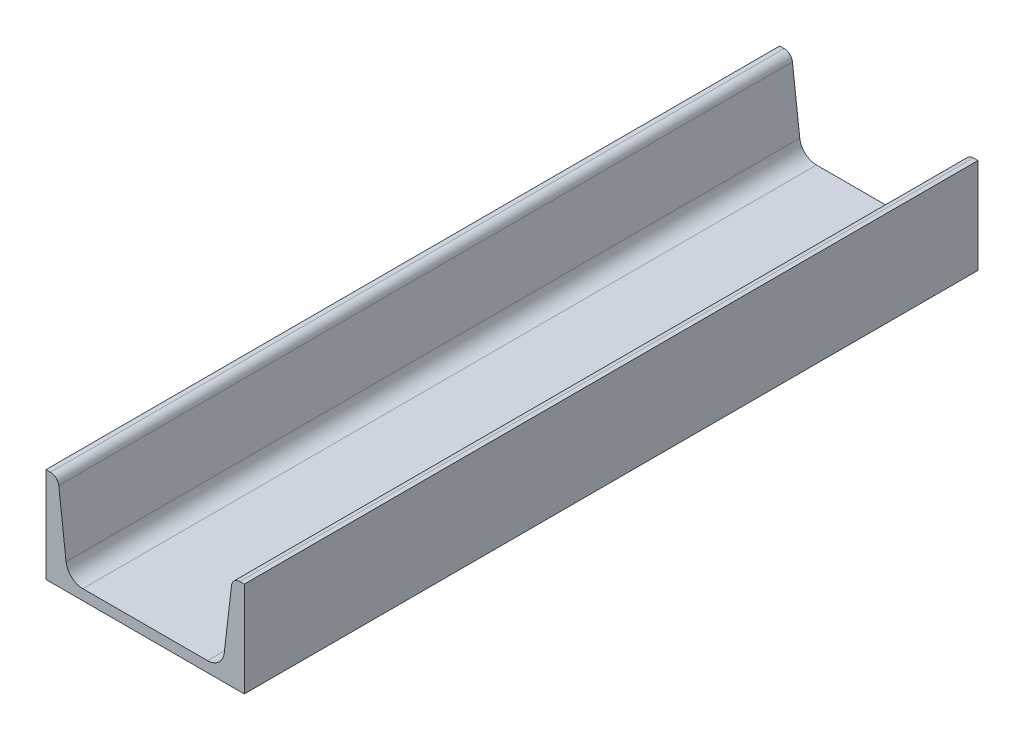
ISO-10303-21;
HEADER;
FILE_DESCRIPTION(('STEP AP214'),'2;1');
FILE_NAME('part.step','',(''),(''),'','','');
FILE_SCHEMA(('AUTOMOTIVE_DESIGN { 1 0 10303 214 1 1 1 1 }'));
ENDSEC;
DATA;
#1=APPLICATION_CONTEXT('core data for automotive mechanical design processes');
#2=APPLICATION_PROTOCOL_DEFINITION('international standard','automotive_design',2000,#1);
#3=PRODUCT_CONTEXT('',#1,'mechanical');
#4=PRODUCT('Part','Part','',(#3));
#5=PRODUCT_RELATED_PRODUCT_CATEGORY('part','',(#4));
#6=PRODUCT_DEFINITION_FORMATION('','',#4);
#7=PRODUCT_DEFINITION_CONTEXT('part definition',#1,'design');
#8=PRODUCT_DEFINITION('design','',#6,#7);
#9=PRODUCT_DEFINITION_SHAPE('','',#8);
#10=(LENGTH_UNIT() NAMED_UNIT(*) SI_UNIT(.MILLI.,.METRE.));
#11=(NAMED_UNIT(*) PLANE_ANGLE_UNIT() SI_UNIT($,.RADIAN.));
#12=(NAMED_UNIT(*) SI_UNIT($,.STERADIAN.) SOLID_ANGLE_UNIT());
#13=UNCERTAINTY_MEASURE_WITH_UNIT(LENGTH_MEASURE(1.E-05),#10,'distance_accuracy_value','');
#14=(GEOMETRIC_REPRESENTATION_CONTEXT(3) GLOBAL_UNCERTAINTY_ASSIGNED_CONTEXT((#13)) GLOBAL_UNIT_ASSIGNED_CONTEXT((#10,
#11,#12)) REPRESENTATION_CONTEXT('',''));
#15=CARTESIAN_POINT('',(0.,0.,0.));
#16=DIRECTION('',(0.,0.,1.));
#17=DIRECTION('',(1.,0.,0.));
#18=AXIS2_PLACEMENT_3D('',#15,#16,#17);
#19=CARTESIAN_POINT('',(-50.,48.,185.));
#20=DIRECTION('',(1.,0.,0.));
#21=DIRECTION('',(0.,1.,0.));
#22=AXIS2_PLACEMENT_3D('',#19,#20,#21);
#23=PLANE('',#22);
#24=DIRECTION('',(0.,-1.,0.));
#25=VECTOR('',#24,1.);
#26=CARTESIAN_POINT('',(-50.,48.,-185.));
#27=LINE('',#26,#25);
#28=CARTESIAN_POINT('',(-50.,48.,-185.));
#29=VERTEX_POINT('',#28);
#30=CARTESIAN_POINT('',(-50.,0.,-185.));
#31=VERTEX_POINT('',#30);
#32=EDGE_CURVE('E131',#29,#31,#27,.T.);
#33=ORIENTED_EDGE('',*,*,#32,.T.);
#34=DIRECTION('',(0.,0.,-1.));
#35=VECTOR('',#34,1.);
#36=CARTESIAN_POINT('',(-50.,0.,185.));
#37=LINE('',#36,#35);
#38=CARTESIAN_POINT('',(-50.,0.,185.));
#39=VERTEX_POINT('',#38);
#40=EDGE_CURVE('E11',#39,#31,#37,.T.);
#41=ORIENTED_EDGE('',*,*,#40,.F.);
#42=DIRECTION('',(0.,-1.,0.));
#43=VECTOR('',#42,1.);
#44=CARTESIAN_POINT('',(-50.,48.,185.));
#45=LINE('',#44,#43);
#46=CARTESIAN_POINT('',(-50.,48.,185.));
#47=VERTEX_POINT('',#46);
#48=EDGE_CURVE('E166',#47,#39,#45,.T.);
#49=ORIENTED_EDGE('',*,*,#48,.F.);
#50=DIRECTION('',(0.,0.,-1.));
#51=VECTOR('',#50,1.);
#52=CARTESIAN_POINT('',(-50.,48.,185.));
#53=LINE('',#52,#51);
#54=EDGE_CURVE('E144',#47,#29,#53,.T.);
#55=ORIENTED_EDGE('',*,*,#54,.T.);
#56=EDGE_LOOP('',(#33,#41,#49,#55));
#57=FACE_BOUND('',#56,.T.);
#58=ADVANCED_FACE('F39',(#57),#23,.F.);
#59=CARTESIAN_POINT('',(-50.,0.,185.));
#60=DIRECTION('',(0.,1.,0.));
#61=DIRECTION('',(0.,0.,1.));
#62=AXIS2_PLACEMENT_3D('',#59,#60,#61);
#63=PLANE('',#62);
#64=DIRECTION('',(1.,0.,0.));
#65=VECTOR('',#64,1.);
#66=CARTESIAN_POINT('',(-50.,0.,-185.));
#67=LINE('',#66,#65);
#68=CARTESIAN_POINT('',(50.,0.,-185.));
#69=VERTEX_POINT('',#68);
#70=EDGE_CURVE('E127',#31,#69,#67,.T.);
#71=ORIENTED_EDGE('',*,*,#70,.T.);
#72=DIRECTION('',(0.,0.,-1.));
#73=VECTOR('',#72,1.);
#74=CARTESIAN_POINT('',(50.,0.,185.));
#75=LINE('',#74,#73);
#76=CARTESIAN_POINT('',(50.,0.,185.));
#77=VERTEX_POINT('',#76);
#78=EDGE_CURVE('E46',#77,#69,#75,.T.);
#79=ORIENTED_EDGE('',*,*,#78,.F.);
#80=DIRECTION('',(1.,0.,0.));
#81=VECTOR('',#80,1.);
#82=CARTESIAN_POINT('',(-50.,0.,185.));
#83=LINE('',#82,#81);
#84=EDGE_CURVE('E140',#39,#77,#83,.T.);
#85=ORIENTED_EDGE('',*,*,#84,.F.);
#86=ORIENTED_EDGE('',*,*,#40,.T.);
#87=EDGE_LOOP('',(#71,#79,#85,#86));
#88=FACE_BOUND('',#87,.T.);
#89=ADVANCED_FACE('F139',(#88),#63,.F.);
#90=CARTESIAN_POINT('',(50.,0.,185.));
#91=DIRECTION('',(-1.,0.,0.));
#92=DIRECTION('',(0.,-1.,0.));
#93=AXIS2_PLACEMENT_3D('',#90,#91,#92);
#94=PLANE('',#93);
#95=DIRECTION('',(0.,1.,0.));
#96=VECTOR('',#95,1.);
#97=CARTESIAN_POINT('',(50.,0.,-185.));
#98=LINE('',#97,#96);
#99=CARTESIAN_POINT('',(50.,48.,-185.));
#100=VERTEX_POINT('',#99);
#101=EDGE_CURVE('E133',#69,#100,#98,.T.);
#102=ORIENTED_EDGE('',*,*,#101,.T.);
#103=DIRECTION('',(0.,0.,-1.));
#104=VECTOR('',#103,1.);
#105=CARTESIAN_POINT('',(50.,48.,185.));
#106=LINE('',#105,#104);
#107=CARTESIAN_POINT('',(50.,48.,185.));
#108=VERTEX_POINT('',#107);
#109=EDGE_CURVE('E212',#108,#100,#106,.T.);
#110=ORIENTED_EDGE('',*,*,#109,.F.);
#111=DIRECTION('',(0.,1.,0.));
#112=VECTOR('',#111,1.);
#113=CARTESIAN_POINT('',(50.,0.,185.));
#114=LINE('',#113,#112);
#115=EDGE_CURVE('E169',#77,#108,#114,.T.);
#116=ORIENTED_EDGE('',*,*,#115,.F.);
#117=ORIENTED_EDGE('',*,*,#78,.T.);
#118=EDGE_LOOP('',(#102,#110,#116,#117));
#119=FACE_BOUND('',#118,.T.);
#120=ADVANCED_FACE('F216',(#119),#94,.F.);
#121=CARTESIAN_POINT('',(50.,48.,185.));
#122=DIRECTION('',(0.,-1.,0.));
#123=DIRECTION('',(0.,0.,-1.));
#124=AXIS2_PLACEMENT_3D('',#121,#122,#123);
#125=PLANE('',#124);
#126=DIRECTION('',(-1.,0.,0.));
#127=VECTOR('',#126,1.);
#128=CARTESIAN_POINT('',(50.,48.,-185.));
#129=LINE('',#128,#127);
#130=CARTESIAN_POINT('',(47.736892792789,48.,-185.));
#131=VERTEX_POINT('',#130);
#132=EDGE_CURVE('E148',#100,#131,#129,.T.);
#133=ORIENTED_EDGE('',*,*,#132,.T.);
#134=DIRECTION('',(0.,0.,-1.));
#135=VECTOR('',#134,1.);
#136=CARTESIAN_POINT('',(47.736892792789,48.,185.));
#137=LINE('',#136,#135);
#138=CARTESIAN_POINT('',(47.736892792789,48.,185.));
#139=VERTEX_POINT('',#138);
#140=EDGE_CURVE('E209',#139,#131,#137,.T.);
#141=ORIENTED_EDGE('',*,*,#140,.F.);
#142=DIRECTION('',(-1.,0.,0.));
#143=VECTOR('',#142,1.);
#144=CARTESIAN_POINT('',(50.,48.,185.));
#145=LINE('',#144,#143);
#146=EDGE_CURVE('E171',#108,#139,#145,.T.);
#147=ORIENTED_EDGE('',*,*,#146,.F.);
#148=ORIENTED_EDGE('',*,*,#109,.T.);
#149=EDGE_LOOP('',(#133,#141,#147,#148));
#150=FACE_BOUND('',#149,.T.);
#151=ADVANCED_FACE('F224',(#150),#125,.F.);
#152=CARTESIAN_POINT('',(47.7368927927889,43.8,185.));
#153=DIRECTION('',(0.,0.,-1.));
#154=DIRECTION('',(-1.,0.,0.));
#155=AXIS2_PLACEMENT_3D('',#152,#153,#154);
#156=CYLINDRICAL_SURFACE('',#155,4.2);
#157=CARTESIAN_POINT('',(47.7368927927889,43.8,-185.));
#158=DIRECTION('',(0.,0.,1.));
#159=DIRECTION('',(1.,0.,0.));
#160=AXIS2_PLACEMENT_3D('',#157,#158,#159);
#161=CIRCLE('',#160,4.2);
#162=CARTESIAN_POINT('',(43.5653941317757,44.2884658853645,-185.));
#163=VERTEX_POINT('',#162);
#164=EDGE_CURVE('E150',#131,#163,#161,.T.);
#165=ORIENTED_EDGE('',*,*,#164,.T.);
#166=DIRECTION('',(0.,0.,-1.));
#167=VECTOR('',#166,1.);
#168=CARTESIAN_POINT('',(43.5653941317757,44.2884658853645,185.));
#169=LINE('',#168,#167);
#170=CARTESIAN_POINT('',(43.5653941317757,44.2884658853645,185.));
#171=VERTEX_POINT('',#170);
#172=EDGE_CURVE('E206',#171,#163,#169,.T.);
#173=ORIENTED_EDGE('',*,*,#172,.F.);
#174=CARTESIAN_POINT('',(47.7368927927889,43.8,185.));
#175=DIRECTION('',(0.,0.,1.));
#176=DIRECTION('',(1.,0.,0.));
#177=AXIS2_PLACEMENT_3D('',#174,#175,#176);
#178=CIRCLE('',#177,4.2);
#179=EDGE_CURVE('E173',#139,#171,#178,.T.);
#180=ORIENTED_EDGE('',*,*,#179,.F.);
#181=ORIENTED_EDGE('',*,*,#140,.T.);
#182=EDGE_LOOP('',(#165,#173,#180,#181));
#183=FACE_BOUND('',#182,.T.);
#184=ADVANCED_FACE('F227',(#183),#156,.T.);
#185=CARTESIAN_POINT('',(43.5653941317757,44.2884658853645,185.));
#186=DIRECTION('',(0.993213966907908,-0.116301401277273,0.));
#187=DIRECTION('',(0.116301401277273,0.993213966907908,0.));
#188=AXIS2_PLACEMENT_3D('',#185,#186,#187);
#189=PLANE('',#188);
#190=DIRECTION('',(-0.116301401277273,-0.993213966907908,0.));
#191=VECTOR('',#190,1.);
#192=CARTESIAN_POINT('',(43.5653941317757,44.2884658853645,-185.));
#193=LINE('',#192,#191);
#194=CARTESIAN_POINT('',(39.8795594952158,12.8114380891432,-185.));
#195=VERTEX_POINT('',#194);
#196=EDGE_CURVE('E152',#163,#195,#193,.T.);
#197=ORIENTED_EDGE('',*,*,#196,.T.);
#198=DIRECTION('',(0.,0.,-1.));
#199=VECTOR('',#198,1.);
#200=CARTESIAN_POINT('',(39.8795594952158,12.8114380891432,185.));
#201=LINE('',#200,#199);
#202=CARTESIAN_POINT('',(39.8795594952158,12.8114380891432,185.));
#203=VERTEX_POINT('',#202);
#204=EDGE_CURVE('E203',#203,#195,#201,.T.);
#205=ORIENTED_EDGE('',*,*,#204,.F.);
#206=DIRECTION('',(-0.116301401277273,-0.993213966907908,0.));
#207=VECTOR('',#206,1.);
#208=CARTESIAN_POINT('',(43.5653941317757,44.2884658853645,185.));
#209=LINE('',#208,#207);
#210=EDGE_CURVE('E175',#171,#203,#209,.T.);
#211=ORIENTED_EDGE('',*,*,#210,.F.);
#212=ORIENTED_EDGE('',*,*,#172,.T.);
#213=EDGE_LOOP('',(#197,#205,#211,#212));
#214=FACE_BOUND('',#213,.T.);
#215=ADVANCED_FACE('F232',(#214),#189,.F.);
#216=CARTESIAN_POINT('',(31.4372407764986,13.8,185.));
#217=DIRECTION('',(0.,0.,-1.));
#218=DIRECTION('',(-1.,0.,0.));
#219=AXIS2_PLACEMENT_3D('',#216,#217,#218);
#220=CYLINDRICAL_SURFACE('',#219,8.5);
#221=CARTESIAN_POINT('',(31.4372407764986,13.8,-185.));
#222=DIRECTION('',(0.,0.,-1.));
#223=DIRECTION('',(-1.,0.,0.));
#224=AXIS2_PLACEMENT_3D('',#221,#222,#223);
#225=CIRCLE('',#224,8.5);
#226=CARTESIAN_POINT('',(31.4372407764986,5.3,-185.));
#227=VERTEX_POINT('',#226);
#228=EDGE_CURVE('E154',#195,#227,#225,.T.);
#229=ORIENTED_EDGE('',*,*,#228,.T.);
#230=DIRECTION('',(0.,0.,-1.));
#231=VECTOR('',#230,1.);
#232=CARTESIAN_POINT('',(31.4372407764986,5.3,185.));
#233=LINE('',#232,#231);
#234=CARTESIAN_POINT('',(31.4372407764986,5.3,185.));
#235=VERTEX_POINT('',#234);
#236=EDGE_CURVE('E200',#235,#227,#233,.T.);
#237=ORIENTED_EDGE('',*,*,#236,.F.);
#238=CARTESIAN_POINT('',(31.4372407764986,13.8,185.));
#239=DIRECTION('',(0.,0.,-1.));
#240=DIRECTION('',(-1.,0.,0.));
#241=AXIS2_PLACEMENT_3D('',#238,#239,#240);
#242=CIRCLE('',#241,8.5);
#243=EDGE_CURVE('E177',#203,#235,#242,.T.);
#244=ORIENTED_EDGE('',*,*,#243,.F.);
#245=ORIENTED_EDGE('',*,*,#204,.T.);
#246=EDGE_LOOP('',(#229,#237,#244,#245));
#247=FACE_BOUND('',#246,.T.);
#248=ADVANCED_FACE('F238',(#247),#220,.F.);
#249=CARTESIAN_POINT('',(31.4372407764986,5.3,185.));
#250=DIRECTION('',(0.,-1.,0.));
#251=DIRECTION('',(1.,0.,0.));
#252=AXIS2_PLACEMENT_3D('',#249,#250,#251);
#253=PLANE('',#252);
#254=DIRECTION('',(-1.,0.,0.));
#255=VECTOR('',#254,1.);
#256=CARTESIAN_POINT('',(31.4372407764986,5.3,-185.));
#257=LINE('',#256,#255);
#258=CARTESIAN_POINT('',(-31.4372407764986,5.29999999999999,-185.));
#259=VERTEX_POINT('',#258);
#260=EDGE_CURVE('E156',#227,#259,#257,.T.);
#261=ORIENTED_EDGE('',*,*,#260,.T.);
#262=DIRECTION('',(0.,0.,-1.));
#263=VECTOR('',#262,1.);
#264=CARTESIAN_POINT('',(-31.4372407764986,5.29999999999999,185.));
#265=LINE('',#264,#263);
#266=CARTESIAN_POINT('',(-31.4372407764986,5.29999999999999,185.));
#267=VERTEX_POINT('',#266);
#268=EDGE_CURVE('E197',#267,#259,#265,.T.);
#269=ORIENTED_EDGE('',*,*,#268,.F.);
#270=DIRECTION('',(-1.,0.,0.));
#271=VECTOR('',#270,1.);
#272=CARTESIAN_POINT('',(31.4372407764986,5.3,185.));
#273=LINE('',#272,#271);
#274=EDGE_CURVE('E179',#235,#267,#273,.T.);
#275=ORIENTED_EDGE('',*,*,#274,.F.);
#276=ORIENTED_EDGE('',*,*,#236,.T.);
#277=EDGE_LOOP('',(#261,#269,#275,#276));
#278=FACE_BOUND('',#277,.T.);
#279=ADVANCED_FACE('F242',(#278),#253,.F.);
#280=CARTESIAN_POINT('',(-31.4372407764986,13.8,185.));
#281=DIRECTION('',(0.,0.,-1.));
#282=DIRECTION('',(-1.,0.,0.));
#283=AXIS2_PLACEMENT_3D('',#280,#281,#282);
#284=CYLINDRICAL_SURFACE('',#283,8.5);
#285=CARTESIAN_POINT('',(-31.4372407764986,13.8,-185.));
#286=DIRECTION('',(0.,0.,-1.));
#287=DIRECTION('',(-1.,0.,0.));
#288=AXIS2_PLACEMENT_3D('',#285,#286,#287);
#289=CIRCLE('',#288,8.5);
#290=CARTESIAN_POINT('',(-39.8795594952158,12.8114380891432,-185.));
#291=VERTEX_POINT('',#290);
#292=EDGE_CURVE('E158',#259,#291,#289,.T.);
#293=ORIENTED_EDGE('',*,*,#292,.T.);
#294=DIRECTION('',(0.,0.,-1.));
#295=VECTOR('',#294,1.);
#296=CARTESIAN_POINT('',(-39.8795594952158,12.8114380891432,185.));
#297=LINE('',#296,#295);
#298=CARTESIAN_POINT('',(-39.8795594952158,12.8114380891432,185.));
#299=VERTEX_POINT('',#298);
#300=EDGE_CURVE('E194',#299,#291,#297,.T.);
#301=ORIENTED_EDGE('',*,*,#300,.F.);
#302=CARTESIAN_POINT('',(-31.4372407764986,13.8,185.));
#303=DIRECTION('',(0.,0.,-1.));
#304=DIRECTION('',(-1.,0.,0.));
#305=AXIS2_PLACEMENT_3D('',#302,#303,#304);
#306=CIRCLE('',#305,8.5);
#307=EDGE_CURVE('E181',#267,#299,#306,.T.);
#308=ORIENTED_EDGE('',*,*,#307,.F.);
#309=ORIENTED_EDGE('',*,*,#268,.T.);
#310=EDGE_LOOP('',(#293,#301,#308,#309));
#311=FACE_BOUND('',#310,.T.);
#312=ADVANCED_FACE('F247',(#311),#284,.F.);
#313=CARTESIAN_POINT('',(-39.8795594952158,12.8114380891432,185.));
#314=DIRECTION('',(-0.993213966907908,-0.116301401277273,0.));
#315=DIRECTION('',(0.116301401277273,-0.993213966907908,0.));
#316=AXIS2_PLACEMENT_3D('',#313,#314,#315);
#317=PLANE('',#316);
#318=DIRECTION('',(-0.116301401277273,0.993213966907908,0.));
#319=VECTOR('',#318,1.);
#320=CARTESIAN_POINT('',(-39.8795594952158,12.8114380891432,-185.));
#321=LINE('',#320,#319);
#322=CARTESIAN_POINT('',(-43.5653941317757,44.2884658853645,-185.));
#323=VERTEX_POINT('',#322);
#324=EDGE_CURVE('E160',#291,#323,#321,.T.);
#325=ORIENTED_EDGE('',*,*,#324,.T.);
#326=DIRECTION('',(0.,0.,-1.));
#327=VECTOR('',#326,1.);
#328=CARTESIAN_POINT('',(-43.5653941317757,44.2884658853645,185.));
#329=LINE('',#328,#327);
#330=CARTESIAN_POINT('',(-43.5653941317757,44.2884658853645,185.));
#331=VERTEX_POINT('',#330);
#332=EDGE_CURVE('E191',#331,#323,#329,.T.);
#333=ORIENTED_EDGE('',*,*,#332,.F.);
#334=DIRECTION('',(-0.116301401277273,0.993213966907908,0.));
#335=VECTOR('',#334,1.);
#336=CARTESIAN_POINT('',(-39.8795594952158,12.8114380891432,185.));
#337=LINE('',#336,#335);
#338=EDGE_CURVE('E183',#299,#331,#337,.T.);
#339=ORIENTED_EDGE('',*,*,#338,.F.);
#340=ORIENTED_EDGE('',*,*,#300,.T.);
#341=EDGE_LOOP('',(#325,#333,#339,#340));
#342=FACE_BOUND('',#341,.T.);
#343=ADVANCED_FACE('F251',(#342),#317,.F.);
#344=CARTESIAN_POINT('',(-47.7368927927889,43.8,185.));
#345=DIRECTION('',(0.,0.,-1.));
#346=DIRECTION('',(-1.,0.,0.));
#347=AXIS2_PLACEMENT_3D('',#344,#345,#346);
#348=CYLINDRICAL_SURFACE('',#347,4.2);
#349=CARTESIAN_POINT('',(-47.7368927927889,43.8,-185.));
#350=DIRECTION('',(0.,0.,1.));
#351=DIRECTION('',(1.,0.,0.));
#352=AXIS2_PLACEMENT_3D('',#349,#350,#351);
#353=CIRCLE('',#352,4.2);
#354=CARTESIAN_POINT('',(-47.736892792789,48.,-185.));
#355=VERTEX_POINT('',#354);
#356=EDGE_CURVE('E162',#323,#355,#353,.T.);
#357=ORIENTED_EDGE('',*,*,#356,.T.);
#358=DIRECTION('',(0.,0.,-1.));
#359=VECTOR('',#358,1.);
#360=CARTESIAN_POINT('',(-47.736892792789,48.,185.));
#361=LINE('',#360,#359);
#362=CARTESIAN_POINT('',(-47.736892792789,48.,185.));
#363=VERTEX_POINT('',#362);
#364=EDGE_CURVE('E188',#363,#355,#361,.T.);
#365=ORIENTED_EDGE('',*,*,#364,.F.);
#366=CARTESIAN_POINT('',(-47.7368927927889,43.8,185.));
#367=DIRECTION('',(0.,0.,1.));
#368=DIRECTION('',(1.,0.,0.));
#369=AXIS2_PLACEMENT_3D('',#366,#367,#368);
#370=CIRCLE('',#369,4.2);
#371=EDGE_CURVE('E58',#331,#363,#370,.T.);
#372=ORIENTED_EDGE('',*,*,#371,.F.);
#373=ORIENTED_EDGE('',*,*,#332,.T.);
#374=EDGE_LOOP('',(#357,#365,#372,#373));
#375=FACE_BOUND('',#374,.T.);
#376=ADVANCED_FACE('F255',(#375),#348,.T.);
#377=CARTESIAN_POINT('',(-47.736892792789,48.,185.));
#378=DIRECTION('',(0.,-1.,0.));
#379=DIRECTION('',(0.,0.,-1.));
#380=AXIS2_PLACEMENT_3D('',#377,#378,#379);
#381=PLANE('',#380);
#382=DIRECTION('',(-1.,0.,0.));
#383=VECTOR('',#382,1.);
#384=CARTESIAN_POINT('',(-47.736892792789,48.,-185.));
#385=LINE('',#384,#383);
#386=EDGE_CURVE('E164',#355,#29,#385,.T.);
#387=ORIENTED_EDGE('',*,*,#386,.T.);
#388=ORIENTED_EDGE('',*,*,#54,.F.);
#389=DIRECTION('',(-1.,0.,0.));
#390=VECTOR('',#389,1.);
#391=CARTESIAN_POINT('',(-47.736892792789,48.,185.));
#392=LINE('',#391,#390);
#393=EDGE_CURVE('E53',#363,#47,#392,.T.);
#394=ORIENTED_EDGE('',*,*,#393,.F.);
#395=ORIENTED_EDGE('',*,*,#364,.T.);
#396=EDGE_LOOP('',(#387,#388,#394,#395));
#397=FACE_BOUND('',#396,.T.);
#398=ADVANCED_FACE('F257',(#397),#381,.F.);
#399=CARTESIAN_POINT('',(47.7368927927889,43.8,185.));
#400=DIRECTION('',(0.,0.,1.));
#401=DIRECTION('',(1.,0.,0.));
#402=AXIS2_PLACEMENT_3D('',#399,#400,#401);
#403=PLANE('',#402);
#404=ORIENTED_EDGE('',*,*,#48,.T.);
#405=ORIENTED_EDGE('',*,*,#84,.T.);
#406=ORIENTED_EDGE('',*,*,#115,.T.);
#407=ORIENTED_EDGE('',*,*,#146,.T.);
#408=ORIENTED_EDGE('',*,*,#179,.T.);
#409=ORIENTED_EDGE('',*,*,#210,.T.);
#410=ORIENTED_EDGE('',*,*,#243,.T.);
#411=ORIENTED_EDGE('',*,*,#274,.T.);
#412=ORIENTED_EDGE('',*,*,#307,.T.);
#413=ORIENTED_EDGE('',*,*,#338,.T.);
#414=ORIENTED_EDGE('',*,*,#371,.T.);
#415=ORIENTED_EDGE('',*,*,#393,.T.);
#416=EDGE_LOOP('',(#404,#405,#406,#407,#408,#409,#410,#411,#412,#413,#414,#415));
#417=FACE_BOUND('',#416,.T.);
#418=ADVANCED_FACE('F219',(#417),#403,.T.);
#419=CARTESIAN_POINT('',(47.7368927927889,43.8,-185.));
#420=DIRECTION('',(0.,0.,1.));
#421=DIRECTION('',(1.,0.,0.));
#422=AXIS2_PLACEMENT_3D('',#419,#420,#421);
#423=PLANE('',#422);
#424=ORIENTED_EDGE('',*,*,#32,.F.);
#425=ORIENTED_EDGE('',*,*,#386,.F.);
#426=ORIENTED_EDGE('',*,*,#356,.F.);
#427=ORIENTED_EDGE('',*,*,#324,.F.);
#428=ORIENTED_EDGE('',*,*,#292,.F.);
#429=ORIENTED_EDGE('',*,*,#260,.F.);
#430=ORIENTED_EDGE('',*,*,#228,.F.);
#431=ORIENTED_EDGE('',*,*,#196,.F.);
#432=ORIENTED_EDGE('',*,*,#164,.F.);
#433=ORIENTED_EDGE('',*,*,#132,.F.);
#434=ORIENTED_EDGE('',*,*,#101,.F.);
#435=ORIENTED_EDGE('',*,*,#70,.F.);
#436=EDGE_LOOP('',(#424,#425,#426,#427,#428,#429,#430,#431,#432,#433,#434,#435));
#437=FACE_BOUND('',#436,.T.);
#438=ADVANCED_FACE('F128',(#437),#423,.F.);
#439=CLOSED_SHELL('',(#58,#89,#120,#151,#184,#215,#248,#279,#312,#343,#376,#398,#418,#438));
#440=MANIFOLD_SOLID_BREP('B2',#439);
#441=ADVANCED_BREP_SHAPE_REPRESENTATION('',(#18,#440),#14);
#442=SHAPE_DEFINITION_REPRESENTATION(#9,#441);
ENDSEC;
END-ISO-10303-21;
